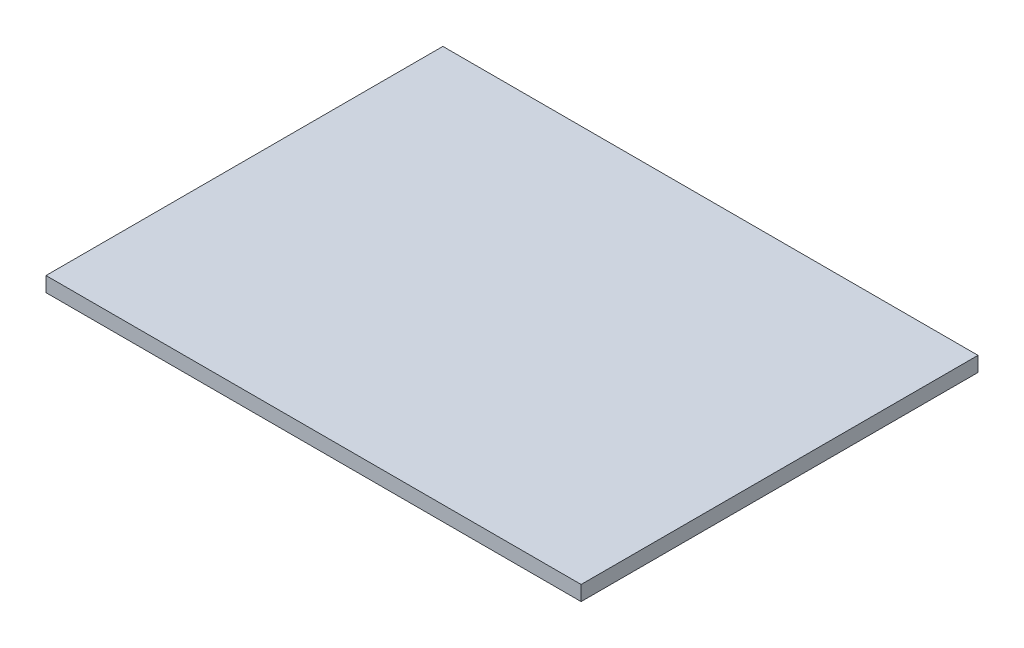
from build123d import *

# Parameters (mm, degrees)
SKETCH1_W           = 360
SKETCH1_H           = 267
BOSS_EXTRUDE1_DEPTH = 5


with BuildPart() as part:
    # Sketch1 → Boss-Extrude1 (new, symmetric)
    with BuildSketch(Plane(origin=(0, 0, 0), x_dir=(1, 0, 0), z_dir=(0, 1, 0))):
        Rectangle(SKETCH1_W, SKETCH1_H)
    extrude(amount=BOSS_EXTRUDE1_DEPTH, both=True)


solid = part.part
